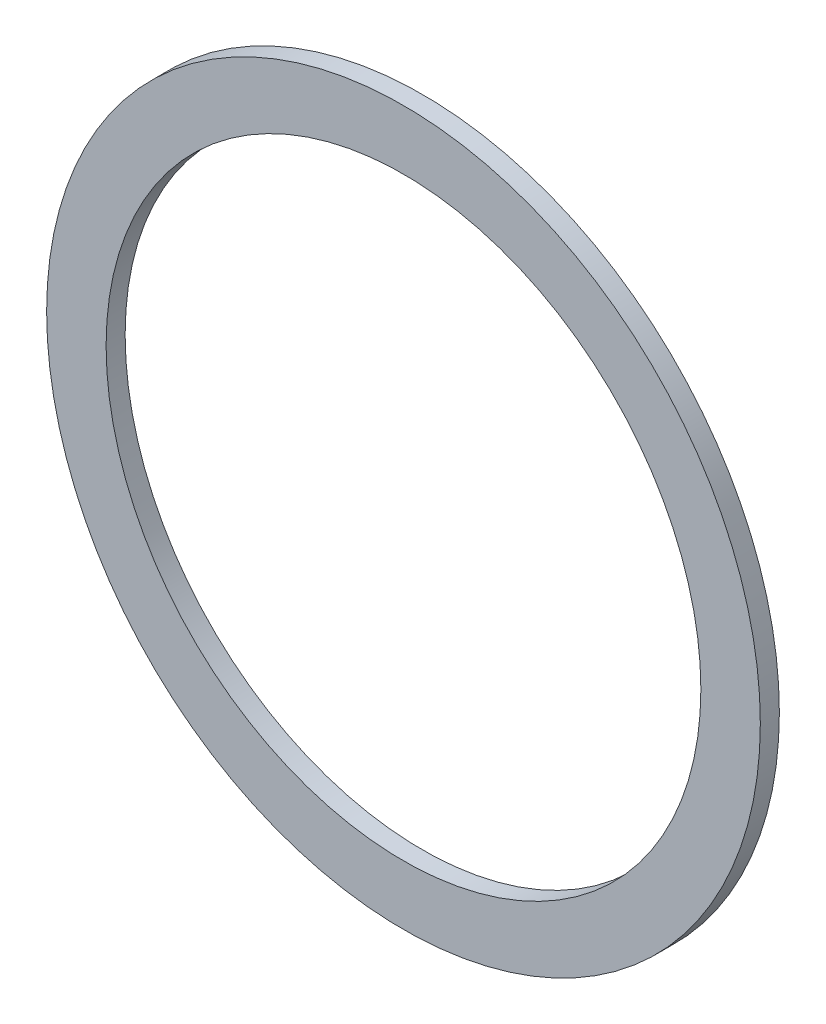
ISO-10303-21;
HEADER;
FILE_DESCRIPTION(('STEP AP214'),'2;1');
FILE_NAME('part.step','',(''),(''),'','','');
FILE_SCHEMA(('AUTOMOTIVE_DESIGN { 1 0 10303 214 1 1 1 1 }'));
ENDSEC;
DATA;
#1=APPLICATION_CONTEXT('core data for automotive mechanical design processes');
#2=APPLICATION_PROTOCOL_DEFINITION('international standard','automotive_design',2000,#1);
#3=PRODUCT_CONTEXT('',#1,'mechanical');
#4=PRODUCT('Part','Part','',(#3));
#5=PRODUCT_RELATED_PRODUCT_CATEGORY('part','',(#4));
#6=PRODUCT_DEFINITION_FORMATION('','',#4);
#7=PRODUCT_DEFINITION_CONTEXT('part definition',#1,'design');
#8=PRODUCT_DEFINITION('design','',#6,#7);
#9=PRODUCT_DEFINITION_SHAPE('','',#8);
#10=(LENGTH_UNIT() NAMED_UNIT(*) SI_UNIT(.MILLI.,.METRE.));
#11=(NAMED_UNIT(*) PLANE_ANGLE_UNIT() SI_UNIT($,.RADIAN.));
#12=(NAMED_UNIT(*) SI_UNIT($,.STERADIAN.) SOLID_ANGLE_UNIT());
#13=UNCERTAINTY_MEASURE_WITH_UNIT(LENGTH_MEASURE(1.E-05),#10,'distance_accuracy_value','');
#14=(GEOMETRIC_REPRESENTATION_CONTEXT(3) GLOBAL_UNCERTAINTY_ASSIGNED_CONTEXT((#13)) GLOBAL_UNIT_ASSIGNED_CONTEXT((#10,
#11,#12)) REPRESENTATION_CONTEXT('',''));
#15=CARTESIAN_POINT('',(0.,0.,0.));
#16=DIRECTION('',(0.,0.,1.));
#17=DIRECTION('',(1.,0.,0.));
#18=AXIS2_PLACEMENT_3D('',#15,#16,#17);
#19=CARTESIAN_POINT('',(0.,0.,0.8));
#20=DIRECTION('',(0.,0.,1.));
#21=DIRECTION('',(1.,0.,0.));
#22=AXIS2_PLACEMENT_3D('',#19,#20,#21);
#23=PLANE('',#22);
#24=CARTESIAN_POINT('',(0.,0.,0.8));
#25=DIRECTION('',(0.,0.,1.));
#26=DIRECTION('',(1.,0.,0.));
#27=AXIS2_PLACEMENT_3D('',#24,#25,#26);
#28=CIRCLE('',#27,15.);
#29=CARTESIAN_POINT('',(15.,0.,0.8));
#30=VERTEX_POINT('',#29);
#31=EDGE_CURVE('E10',#30,#30,#28,.T.);
#32=ORIENTED_EDGE('',*,*,#31,.T.);
#33=EDGE_LOOP('',(#32));
#34=FACE_BOUND('',#33,.T.);
#35=CARTESIAN_POINT('',(0.,0.,0.8));
#36=DIRECTION('',(0.,0.,1.));
#37=DIRECTION('',(1.,0.,0.));
#38=AXIS2_PLACEMENT_3D('',#35,#36,#37);
#39=CIRCLE('',#38,12.5);
#40=CARTESIAN_POINT('',(12.5,0.,0.8));
#41=VERTEX_POINT('',#40);
#42=EDGE_CURVE('E42',#41,#41,#39,.T.);
#43=ORIENTED_EDGE('',*,*,#42,.F.);
#44=EDGE_LOOP('',(#43));
#45=FACE_BOUND('',#44,.T.);
#46=ADVANCED_FACE('F31',(#34,#45),#23,.T.);
#47=CARTESIAN_POINT('',(0.,0.,0.));
#48=DIRECTION('',(0.,0.,1.));
#49=DIRECTION('',(1.,0.,0.));
#50=AXIS2_PLACEMENT_3D('',#47,#48,#49);
#51=PLANE('',#50);
#52=CARTESIAN_POINT('',(0.,0.,0.));
#53=DIRECTION('',(0.,0.,1.));
#54=DIRECTION('',(1.,0.,0.));
#55=AXIS2_PLACEMENT_3D('',#52,#53,#54);
#56=CIRCLE('',#55,15.);
#57=CARTESIAN_POINT('',(15.,0.,0.));
#58=VERTEX_POINT('',#57);
#59=EDGE_CURVE('E35',#58,#58,#56,.T.);
#60=ORIENTED_EDGE('',*,*,#59,.F.);
#61=EDGE_LOOP('',(#60));
#62=FACE_BOUND('',#61,.T.);
#63=CARTESIAN_POINT('',(0.,0.,0.));
#64=DIRECTION('',(0.,0.,1.));
#65=DIRECTION('',(1.,0.,0.));
#66=AXIS2_PLACEMENT_3D('',#63,#64,#65);
#67=CIRCLE('',#66,12.5);
#68=CARTESIAN_POINT('',(12.5,0.,0.));
#69=VERTEX_POINT('',#68);
#70=EDGE_CURVE('E44',#69,#69,#67,.T.);
#71=ORIENTED_EDGE('',*,*,#70,.T.);
#72=EDGE_LOOP('',(#71));
#73=FACE_BOUND('',#72,.T.);
#74=ADVANCED_FACE('F54',(#62,#73),#51,.F.);
#75=CARTESIAN_POINT('',(0.,0.,0.8));
#76=DIRECTION('',(0.,0.,-1.));
#77=DIRECTION('',(-1.,0.,0.));
#78=AXIS2_PLACEMENT_3D('',#75,#76,#77);
#79=CYLINDRICAL_SURFACE('',#78,15.);
#80=ORIENTED_EDGE('',*,*,#31,.F.);
#81=EDGE_LOOP('',(#80));
#82=FACE_BOUND('',#81,.T.);
#83=ORIENTED_EDGE('',*,*,#59,.T.);
#84=EDGE_LOOP('',(#83));
#85=FACE_BOUND('',#84,.T.);
#86=ADVANCED_FACE('F33',(#82,#85),#79,.T.);
#87=CARTESIAN_POINT('',(0.,0.,0.8));
#88=DIRECTION('',(0.,0.,-1.));
#89=DIRECTION('',(-1.,0.,0.));
#90=AXIS2_PLACEMENT_3D('',#87,#88,#89);
#91=CYLINDRICAL_SURFACE('',#90,12.5);
#92=ORIENTED_EDGE('',*,*,#42,.T.);
#93=EDGE_LOOP('',(#92));
#94=FACE_BOUND('',#93,.T.);
#95=ORIENTED_EDGE('',*,*,#70,.F.);
#96=EDGE_LOOP('',(#95));
#97=FACE_BOUND('',#96,.T.);
#98=ADVANCED_FACE('F50',(#94,#97),#91,.F.);
#99=CLOSED_SHELL('',(#46,#74,#86,#98));
#100=MANIFOLD_SOLID_BREP('B2',#99);
#101=ADVANCED_BREP_SHAPE_REPRESENTATION('',(#18,#100),#14);
#102=SHAPE_DEFINITION_REPRESENTATION(#9,#101);
ENDSEC;
END-ISO-10303-21;
